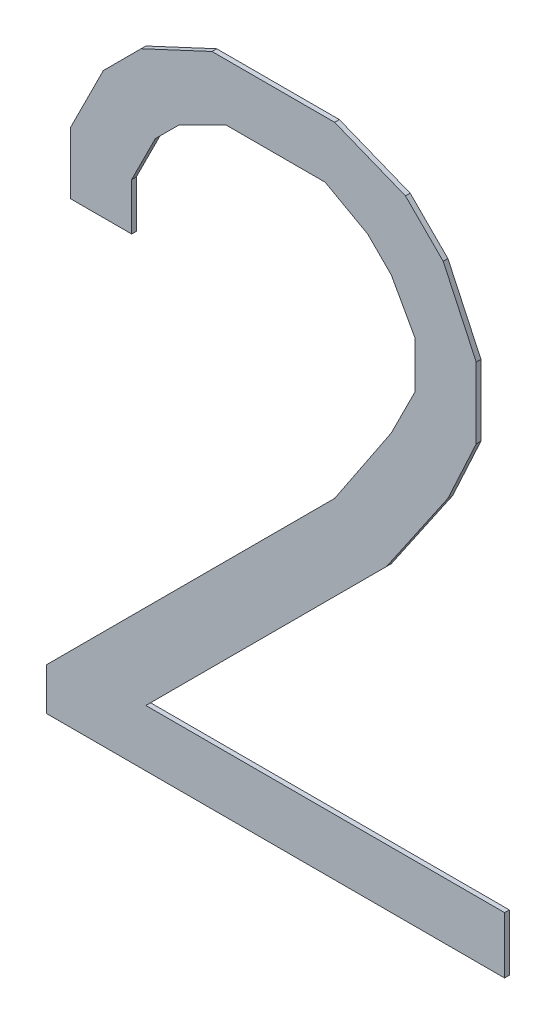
ISO-10303-21;
HEADER;
FILE_DESCRIPTION(('STEP AP214'),'2;1');
FILE_NAME('part.step','',(''),(''),'','','');
FILE_SCHEMA(('AUTOMOTIVE_DESIGN { 1 0 10303 214 1 1 1 1 }'));
ENDSEC;
DATA;
#1=APPLICATION_CONTEXT('core data for automotive mechanical design processes');
#2=APPLICATION_PROTOCOL_DEFINITION('international standard','automotive_design',2000,#1);
#3=PRODUCT_CONTEXT('',#1,'mechanical');
#4=PRODUCT('Part','Part','',(#3));
#5=PRODUCT_RELATED_PRODUCT_CATEGORY('part','',(#4));
#6=PRODUCT_DEFINITION_FORMATION('','',#4);
#7=PRODUCT_DEFINITION_CONTEXT('part definition',#1,'design');
#8=PRODUCT_DEFINITION('design','',#6,#7);
#9=PRODUCT_DEFINITION_SHAPE('','',#8);
#10=(LENGTH_UNIT() NAMED_UNIT(*) SI_UNIT(.MILLI.,.METRE.));
#11=(NAMED_UNIT(*) PLANE_ANGLE_UNIT() SI_UNIT($,.RADIAN.));
#12=(NAMED_UNIT(*) SI_UNIT($,.STERADIAN.) SOLID_ANGLE_UNIT());
#13=UNCERTAINTY_MEASURE_WITH_UNIT(LENGTH_MEASURE(1.E-05),#10,'distance_accuracy_value','');
#14=(GEOMETRIC_REPRESENTATION_CONTEXT(3) GLOBAL_UNCERTAINTY_ASSIGNED_CONTEXT((#13)) GLOBAL_UNIT_ASSIGNED_CONTEXT((#10,
#11,#12)) REPRESENTATION_CONTEXT('',''));
#15=CARTESIAN_POINT('',(0.,0.,0.));
#16=DIRECTION('',(0.,0.,1.));
#17=DIRECTION('',(1.,0.,0.));
#18=AXIS2_PLACEMENT_3D('',#15,#16,#17);
#19=CARTESIAN_POINT('',(-0.4350004,0.27500072,0.01));
#20=DIRECTION('',(0.,0.,-1.));
#21=DIRECTION('',(-1.,0.,0.));
#22=AXIS2_PLACEMENT_3D('',#19,#20,#21);
#23=PLANE('',#22);
#24=DIRECTION('',(0.,1.,0.));
#25=VECTOR('',#24,1.);
#26=CARTESIAN_POINT('',(-0.30500066,0.27500072,0.01));
#27=LINE('',#26,#25);
#28=CARTESIAN_POINT('',(-0.30500066,0.27500072,0.01));
#29=VERTEX_POINT('',#28);
#30=CARTESIAN_POINT('',(-0.30500066,0.37500052,0.01));
#31=VERTEX_POINT('',#30);
#32=EDGE_CURVE('E326',#29,#31,#27,.T.);
#33=ORIENTED_EDGE('',*,*,#32,.T.);
#34=DIRECTION('',(-0.447213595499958,-0.894427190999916,0.));
#35=VECTOR('',#34,1.);
#36=CARTESIAN_POINT('',(-0.30500066,0.37500052,0.01));
#37=LINE('',#36,#35);
#38=CARTESIAN_POINT('',(-0.25500076,0.47500032,0.01));
#39=VERTEX_POINT('',#38);
#40=EDGE_CURVE('E322',#31,#39,#37,.F.);
#41=ORIENTED_EDGE('',*,*,#40,.T.);
#42=DIRECTION('',(-0.707106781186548,-0.707106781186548,0.));
#43=VECTOR('',#42,1.);
#44=CARTESIAN_POINT('',(-0.25500076,0.47500032,0.01));
#45=LINE('',#44,#43);
#46=CARTESIAN_POINT('',(-0.20500086,0.52500022,0.01));
#47=VERTEX_POINT('',#46);
#48=EDGE_CURVE('E318',#39,#47,#45,.F.);
#49=ORIENTED_EDGE('',*,*,#48,.T.);
#50=DIRECTION('',(-0.894427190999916,-0.447213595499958,0.));
#51=VECTOR('',#50,1.);
#52=CARTESIAN_POINT('',(-0.20500086,0.52500022,0.01));
#53=LINE('',#52,#51);
#54=CARTESIAN_POINT('',(-0.10500106,0.57500012,0.01));
#55=VERTEX_POINT('',#54);
#56=EDGE_CURVE('E314',#47,#55,#53,.F.);
#57=ORIENTED_EDGE('',*,*,#56,.T.);
#58=DIRECTION('',(1.,0.,0.));
#59=VECTOR('',#58,1.);
#60=CARTESIAN_POINT('',(-0.10500106,0.57500012,0.01));
#61=LINE('',#60,#59);
#62=CARTESIAN_POINT('',(0.10500106,0.57500012,0.01));
#63=VERTEX_POINT('',#62);
#64=EDGE_CURVE('E310',#55,#63,#61,.T.);
#65=ORIENTED_EDGE('',*,*,#64,.T.);
#66=DIRECTION('',(-0.874157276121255,0.485642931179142,0.));
#67=VECTOR('',#66,1.);
#68=CARTESIAN_POINT('',(0.10500106,0.57500012,0.01));
#69=LINE('',#68,#67);
#70=CARTESIAN_POINT('',(0.195000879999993,0.525000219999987,0.01));
#71=VERTEX_POINT('',#70);
#72=EDGE_CURVE('E306',#63,#71,#69,.F.);
#73=ORIENTED_EDGE('',*,*,#72,.T.);
#74=DIRECTION('',(-0.707106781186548,0.707106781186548,0.));
#75=VECTOR('',#74,1.);
#76=CARTESIAN_POINT('',(0.19500088,0.52500022,0.01));
#77=LINE('',#76,#75);
#78=CARTESIAN_POINT('',(0.24500078,0.47500032,0.01));
#79=VERTEX_POINT('',#78);
#80=EDGE_CURVE('E302',#71,#79,#77,.F.);
#81=ORIENTED_EDGE('',*,*,#80,.T.);
#82=DIRECTION('',(-0.485642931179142,0.874157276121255,0.));
#83=VECTOR('',#82,1.);
#84=CARTESIAN_POINT('',(0.24500078,0.47500032,0.01));
#85=LINE('',#84,#83);
#86=CARTESIAN_POINT('',(0.295000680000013,0.385000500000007,0.01));
#87=VERTEX_POINT('',#86);
#88=EDGE_CURVE('E298',#79,#87,#85,.F.);
#89=ORIENTED_EDGE('',*,*,#88,.T.);
#90=DIRECTION('',(0.,1.,0.));
#91=VECTOR('',#90,1.);
#92=CARTESIAN_POINT('',(0.29500068,0.3850005,0.01));
#93=LINE('',#92,#91);
#94=CARTESIAN_POINT('',(0.29500068,0.2850007,0.01));
#95=VERTEX_POINT('',#94);
#96=EDGE_CURVE('E294',#87,#95,#93,.F.);
#97=ORIENTED_EDGE('',*,*,#96,.T.);
#98=DIRECTION('',(0.447204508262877,0.894431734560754,0.));
#99=VECTOR('',#98,1.);
#100=CARTESIAN_POINT('',(0.29500068,0.2850007,0.01));
#101=LINE('',#100,#99);
#102=CARTESIAN_POINT('',(0.245000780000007,0.184998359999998,0.01));
#103=VERTEX_POINT('',#102);
#104=EDGE_CURVE('E290',#95,#103,#101,.F.);
#105=ORIENTED_EDGE('',*,*,#104,.T.);
#106=DIRECTION('',(0.554700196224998,0.832050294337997,0.));
#107=VECTOR('',#106,1.);
#108=CARTESIAN_POINT('',(0.24500078,0.18499836,0.01));
#109=LINE('',#108,#107);
#110=CARTESIAN_POINT('',(0.125001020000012,0.00499871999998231,0.01));
#111=VERTEX_POINT('',#110);
#112=EDGE_CURVE('E286',#103,#111,#109,.F.);
#113=ORIENTED_EDGE('',*,*,#112,.T.);
#114=DIRECTION('',(0.707108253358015,0.707105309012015,0.));
#115=VECTOR('',#114,1.);
#116=CARTESIAN_POINT('',(0.12500102,0.004998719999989,0.01));
#117=LINE('',#116,#115);
#118=CARTESIAN_POINT('',(-0.485000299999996,-0.605000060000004,0.01));
#119=VERTEX_POINT('',#118);
#120=EDGE_CURVE('E282',#111,#119,#117,.F.);
#121=ORIENTED_EDGE('',*,*,#120,.T.);
#122=DIRECTION('',(0.,1.,0.));
#123=VECTOR('',#122,1.);
#124=CARTESIAN_POINT('',(-0.4850003,-0.60500006,0.01));
#125=LINE('',#124,#123);
#126=CARTESIAN_POINT('',(-0.4850003,-0.69499988,0.01));
#127=VERTEX_POINT('',#126);
#128=EDGE_CURVE('E278',#119,#127,#125,.F.);
#129=ORIENTED_EDGE('',*,*,#128,.T.);
#130=DIRECTION('',(1.,0.,0.));
#131=VECTOR('',#130,1.);
#132=CARTESIAN_POINT('',(-0.4850003,-0.69499988,0.01));
#133=LINE('',#132,#131);
#134=CARTESIAN_POINT('',(0.4850003,-0.69499988,0.01));
#135=VERTEX_POINT('',#134);
#136=EDGE_CURVE('E274',#127,#135,#133,.T.);
#137=ORIENTED_EDGE('',*,*,#136,.T.);
#138=DIRECTION('',(0.,1.,0.));
#139=VECTOR('',#138,1.);
#140=CARTESIAN_POINT('',(0.4850003,-0.69499988,0.01));
#141=LINE('',#140,#139);
#142=CARTESIAN_POINT('',(0.4850003,-0.57500012,0.01));
#143=VERTEX_POINT('',#142);
#144=EDGE_CURVE('E270',#135,#143,#141,.T.);
#145=ORIENTED_EDGE('',*,*,#144,.T.);
#146=DIRECTION('',(1.,0.,0.));
#147=VECTOR('',#146,1.);
#148=CARTESIAN_POINT('',(0.4850003,-0.57500012,0.01));
#149=LINE('',#148,#147);
#150=CARTESIAN_POINT('',(-0.27500072,-0.57500012,0.01));
#151=VERTEX_POINT('',#150);
#152=EDGE_CURVE('E266',#143,#151,#149,.F.);
#153=ORIENTED_EDGE('',*,*,#152,.T.);
#154=DIRECTION('',(-0.707108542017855,-0.707105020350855,0.));
#155=VECTOR('',#154,1.);
#156=CARTESIAN_POINT('',(-0.27500072,-0.57500012,0.01));
#157=LINE('',#156,#155);
#158=CARTESIAN_POINT('',(0.235000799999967,-0.0650011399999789,0.01));
#159=VERTEX_POINT('',#158);
#160=EDGE_CURVE('E262',#151,#159,#157,.F.);
#161=ORIENTED_EDGE('',*,*,#160,.T.);
#162=DIRECTION('',(-0.564683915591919,-0.825307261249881,0.));
#163=VECTOR('',#162,1.);
#164=CARTESIAN_POINT('',(0.2350008,-0.06500114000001,0.01));
#165=LINE('',#164,#163);
#166=CARTESIAN_POINT('',(0.365000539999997,0.124998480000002,0.01));
#167=VERTEX_POINT('',#166);
#168=EDGE_CURVE('E258',#159,#167,#165,.F.);
#169=ORIENTED_EDGE('',*,*,#168,.T.);
#170=DIRECTION('',(-0.419051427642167,-0.907962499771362,0.));
#171=VECTOR('',#170,1.);
#172=CARTESIAN_POINT('',(0.36500054,0.12499848,0.01));
#173=LINE('',#172,#171);
#174=CARTESIAN_POINT('',(0.42500041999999,0.255000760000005,0.01));
#175=VERTEX_POINT('',#174);
#176=EDGE_CURVE('E254',#167,#175,#173,.F.);
#177=ORIENTED_EDGE('',*,*,#176,.T.);
#178=DIRECTION('',(0.,1.,0.));
#179=VECTOR('',#178,1.);
#180=CARTESIAN_POINT('',(0.42500042,0.25500076,0.01));
#181=LINE('',#180,#179);
#182=CARTESIAN_POINT('',(0.42500042,0.40500046,0.01));
#183=VERTEX_POINT('',#182);
#184=EDGE_CURVE('E250',#175,#183,#181,.T.);
#185=ORIENTED_EDGE('',*,*,#184,.T.);
#186=DIRECTION('',(0.422885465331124,-0.906183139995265,0.));
#187=VECTOR('',#186,1.);
#188=CARTESIAN_POINT('',(0.42500042,0.40500046,0.01));
#189=LINE('',#188,#187);
#190=CARTESIAN_POINT('',(0.35500056,0.55500016,0.01));
#191=VERTEX_POINT('',#190);
#192=EDGE_CURVE('E246',#183,#191,#189,.F.);
#193=ORIENTED_EDGE('',*,*,#192,.T.);
#194=DIRECTION('',(0.707106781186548,-0.707106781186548,0.));
#195=VECTOR('',#194,1.);
#196=CARTESIAN_POINT('',(0.35500056,0.55500016,0.01));
#197=LINE('',#196,#195);
#198=CARTESIAN_POINT('',(0.27500072,0.635,0.01));
#199=VERTEX_POINT('',#198);
#200=EDGE_CURVE('E242',#191,#199,#197,.F.);
#201=ORIENTED_EDGE('',*,*,#200,.T.);
#202=DIRECTION('',(0.928476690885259,-0.371390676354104,0.));
#203=VECTOR('',#202,1.);
#204=CARTESIAN_POINT('',(0.27500072,0.635,0.01));
#205=LINE('',#204,#203);
#206=CARTESIAN_POINT('',(0.12500102,0.69499988,0.01));
#207=VERTEX_POINT('',#206);
#208=EDGE_CURVE('E238',#199,#207,#205,.F.);
#209=ORIENTED_EDGE('',*,*,#208,.T.);
#210=DIRECTION('',(1.,0.,0.));
#211=VECTOR('',#210,1.);
#212=CARTESIAN_POINT('',(0.12500102,0.69499988,0.01));
#213=LINE('',#212,#211);
#214=CARTESIAN_POINT('',(-0.135001,0.69499988,0.01));
#215=VERTEX_POINT('',#214);
#216=EDGE_CURVE('E234',#207,#215,#213,.F.);
#217=ORIENTED_EDGE('',*,*,#216,.T.);
#218=DIRECTION('',(0.906183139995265,0.422885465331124,0.));
#219=VECTOR('',#218,1.);
#220=CARTESIAN_POINT('',(-0.135001,0.69499988,0.01));
#221=LINE('',#220,#219);
#222=CARTESIAN_POINT('',(-0.2850007,0.62500002,0.01));
#223=VERTEX_POINT('',#222);
#224=EDGE_CURVE('E230',#215,#223,#221,.F.);
#225=ORIENTED_EDGE('',*,*,#224,.T.);
#226=DIRECTION('',(0.707106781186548,0.707106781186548,0.));
#227=VECTOR('',#226,1.);
#228=CARTESIAN_POINT('',(-0.2850007,0.62500002,0.01));
#229=LINE('',#228,#227);
#230=CARTESIAN_POINT('',(-0.36500054,0.54500018,0.01));
#231=VERTEX_POINT('',#230);
#232=EDGE_CURVE('E206',#223,#231,#229,.F.);
#233=ORIENTED_EDGE('',*,*,#232,.T.);
#234=DIRECTION('',(0.447213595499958,0.894427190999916,0.));
#235=VECTOR('',#234,1.);
#236=CARTESIAN_POINT('',(-0.36500054,0.54500018,0.01));
#237=LINE('',#236,#235);
#238=CARTESIAN_POINT('',(-0.4350004,0.40500046,0.01));
#239=VERTEX_POINT('',#238);
#240=EDGE_CURVE('E208',#231,#239,#237,.F.);
#241=ORIENTED_EDGE('',*,*,#240,.T.);
#242=DIRECTION('',(0.,1.,0.));
#243=VECTOR('',#242,1.);
#244=CARTESIAN_POINT('',(-0.4350004,0.40500046,0.01));
#245=LINE('',#244,#243);
#246=CARTESIAN_POINT('',(-0.4350004,0.27500072,0.01));
#247=VERTEX_POINT('',#246);
#248=EDGE_CURVE('E20',#239,#247,#245,.F.);
#249=ORIENTED_EDGE('',*,*,#248,.T.);
#250=DIRECTION('',(1.,0.,0.));
#251=VECTOR('',#250,1.);
#252=CARTESIAN_POINT('',(-0.4350004,0.27500072,0.01));
#253=LINE('',#252,#251);
#254=EDGE_CURVE('E331',#247,#29,#253,.T.);
#255=ORIENTED_EDGE('',*,*,#254,.T.);
#256=EDGE_LOOP('',(#33,#41,#49,#57,#65,#73,#81,#89,#97,#105,#113,#121,#129,#137,#145,#153,#161,
#169,#177,#185,#193,#201,#209,#217,#225,#233,#241,#249,#255));
#257=FACE_BOUND('',#256,.T.);
#258=ADVANCED_FACE('F17',(#257),#23,.F.);
#259=CARTESIAN_POINT('',(-0.4350004,0.40500046,0.));
#260=DIRECTION('',(1.,0.,0.));
#261=DIRECTION('',(0.,0.,-1.));
#262=AXIS2_PLACEMENT_3D('',#259,#260,#261);
#263=PLANE('',#262);
#264=DIRECTION('',(0.,0.,1.));
#265=VECTOR('',#264,1.);
#266=CARTESIAN_POINT('',(-0.4350004,0.27500072,0.));
#267=LINE('',#266,#265);
#268=CARTESIAN_POINT('',(-0.4350004,0.27500072,0.));
#269=VERTEX_POINT('',#268);
#270=EDGE_CURVE('E219',#269,#247,#267,.T.);
#271=ORIENTED_EDGE('',*,*,#270,.T.);
#272=ORIENTED_EDGE('',*,*,#248,.F.);
#273=DIRECTION('',(0.,0.,1.));
#274=VECTOR('',#273,1.);
#275=CARTESIAN_POINT('',(-0.4350004,0.40500046,0.));
#276=LINE('',#275,#274);
#277=CARTESIAN_POINT('',(-0.4350004,0.40500046,0.));
#278=VERTEX_POINT('',#277);
#279=EDGE_CURVE('E214',#239,#278,#276,.F.);
#280=ORIENTED_EDGE('',*,*,#279,.T.);
#281=DIRECTION('',(0.,1.,0.));
#282=VECTOR('',#281,1.);
#283=CARTESIAN_POINT('',(-0.4350004,0.27500072,0.));
#284=LINE('',#283,#282);
#285=EDGE_CURVE('E334',#269,#278,#284,.T.);
#286=ORIENTED_EDGE('',*,*,#285,.F.);
#287=EDGE_LOOP('',(#271,#272,#280,#286));
#288=FACE_BOUND('',#287,.T.);
#289=ADVANCED_FACE('F216',(#288),#263,.F.);
#290=CARTESIAN_POINT('',(-0.36500054,0.54500018,0.));
#291=DIRECTION('',(0.894427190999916,-0.447213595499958,0.));
#292=DIRECTION('',(0.447213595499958,0.894427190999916,0.));
#293=AXIS2_PLACEMENT_3D('',#290,#291,#292);
#294=PLANE('',#293);
#295=ORIENTED_EDGE('',*,*,#279,.F.);
#296=ORIENTED_EDGE('',*,*,#240,.F.);
#297=DIRECTION('',(0.,0.,1.));
#298=VECTOR('',#297,1.);
#299=CARTESIAN_POINT('',(-0.36500054,0.54500018,0.));
#300=LINE('',#299,#298);
#301=CARTESIAN_POINT('',(-0.36500054,0.54500018,0.));
#302=VERTEX_POINT('',#301);
#303=EDGE_CURVE('E226',#231,#302,#300,.F.);
#304=ORIENTED_EDGE('',*,*,#303,.T.);
#305=DIRECTION('',(0.447213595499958,0.894427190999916,0.));
#306=VECTOR('',#305,1.);
#307=CARTESIAN_POINT('',(-0.4350004,0.40500046,0.));
#308=LINE('',#307,#306);
#309=EDGE_CURVE('E223',#278,#302,#308,.T.);
#310=ORIENTED_EDGE('',*,*,#309,.F.);
#311=EDGE_LOOP('',(#295,#296,#304,#310));
#312=FACE_BOUND('',#311,.T.);
#313=ADVANCED_FACE('F221',(#312),#294,.F.);
#314=CARTESIAN_POINT('',(-0.2850007,0.62500002,0.));
#315=DIRECTION('',(0.707106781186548,-0.707106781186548,0.));
#316=DIRECTION('',(0.707106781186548,0.707106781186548,0.));
#317=AXIS2_PLACEMENT_3D('',#314,#315,#316);
#318=PLANE('',#317);
#319=ORIENTED_EDGE('',*,*,#303,.F.);
#320=ORIENTED_EDGE('',*,*,#232,.F.);
#321=DIRECTION('',(0.,0.,1.));
#322=VECTOR('',#321,1.);
#323=CARTESIAN_POINT('',(-0.2850007,0.62500002,0.));
#324=LINE('',#323,#322);
#325=CARTESIAN_POINT('',(-0.2850007,0.62500002,0.));
#326=VERTEX_POINT('',#325);
#327=EDGE_CURVE('E232',#223,#326,#324,.F.);
#328=ORIENTED_EDGE('',*,*,#327,.T.);
#329=DIRECTION('',(0.707106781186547,0.707106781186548,0.));
#330=VECTOR('',#329,1.);
#331=CARTESIAN_POINT('',(-0.36500054,0.54500018,0.));
#332=LINE('',#331,#330);
#333=EDGE_CURVE('E337',#302,#326,#332,.T.);
#334=ORIENTED_EDGE('',*,*,#333,.F.);
#335=EDGE_LOOP('',(#319,#320,#328,#334));
#336=FACE_BOUND('',#335,.T.);
#337=ADVANCED_FACE('F539',(#336),#318,.F.);
#338=CARTESIAN_POINT('',(-0.135001,0.69499988,0.));
#339=DIRECTION('',(0.422885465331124,-0.906183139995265,0.));
#340=DIRECTION('',(0.906183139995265,0.422885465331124,0.));
#341=AXIS2_PLACEMENT_3D('',#338,#339,#340);
#342=PLANE('',#341);
#343=ORIENTED_EDGE('',*,*,#327,.F.);
#344=ORIENTED_EDGE('',*,*,#224,.F.);
#345=DIRECTION('',(0.,0.,-1.));
#346=VECTOR('',#345,1.);
#347=CARTESIAN_POINT('',(-0.135001,0.69499988,0.));
#348=LINE('',#347,#346);
#349=CARTESIAN_POINT('',(-0.135001,0.69499988,0.));
#350=VERTEX_POINT('',#349);
#351=EDGE_CURVE('E236',#215,#350,#348,.T.);
#352=ORIENTED_EDGE('',*,*,#351,.T.);
#353=DIRECTION('',(0.906183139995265,0.422885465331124,0.));
#354=VECTOR('',#353,1.);
#355=CARTESIAN_POINT('',(-0.2850007,0.62500002,0.));
#356=LINE('',#355,#354);
#357=EDGE_CURVE('E340',#326,#350,#356,.T.);
#358=ORIENTED_EDGE('',*,*,#357,.F.);
#359=EDGE_LOOP('',(#343,#344,#352,#358));
#360=FACE_BOUND('',#359,.T.);
#361=ADVANCED_FACE('F535',(#360),#342,.F.);
#362=CARTESIAN_POINT('',(0.12500102,0.69499988,0.));
#363=DIRECTION('',(0.,-1.,0.));
#364=DIRECTION('',(0.,0.,-1.));
#365=AXIS2_PLACEMENT_3D('',#362,#363,#364);
#366=PLANE('',#365);
#367=ORIENTED_EDGE('',*,*,#351,.F.);
#368=ORIENTED_EDGE('',*,*,#216,.F.);
#369=DIRECTION('',(0.,0.,1.));
#370=VECTOR('',#369,1.);
#371=CARTESIAN_POINT('',(0.12500102,0.69499988,0.));
#372=LINE('',#371,#370);
#373=CARTESIAN_POINT('',(0.12500102,0.69499988,0.));
#374=VERTEX_POINT('',#373);
#375=EDGE_CURVE('E240',#207,#374,#372,.F.);
#376=ORIENTED_EDGE('',*,*,#375,.T.);
#377=DIRECTION('',(-1.,0.,0.));
#378=VECTOR('',#377,1.);
#379=CARTESIAN_POINT('',(-0.4350004,0.69499988,0.));
#380=LINE('',#379,#378);
#381=EDGE_CURVE('E343',#350,#374,#380,.F.);
#382=ORIENTED_EDGE('',*,*,#381,.F.);
#383=EDGE_LOOP('',(#367,#368,#376,#382));
#384=FACE_BOUND('',#383,.T.);
#385=ADVANCED_FACE('F531',(#384),#366,.F.);
#386=CARTESIAN_POINT('',(0.27500072,0.635,0.));
#387=DIRECTION('',(-0.371390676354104,-0.928476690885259,0.));
#388=DIRECTION('',(0.928476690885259,-0.371390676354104,0.));
#389=AXIS2_PLACEMENT_3D('',#386,#387,#388);
#390=PLANE('',#389);
#391=ORIENTED_EDGE('',*,*,#375,.F.);
#392=ORIENTED_EDGE('',*,*,#208,.F.);
#393=DIRECTION('',(0.,0.,1.));
#394=VECTOR('',#393,1.);
#395=CARTESIAN_POINT('',(0.27500072,0.635,0.));
#396=LINE('',#395,#394);
#397=CARTESIAN_POINT('',(0.27500072,0.635,0.));
#398=VERTEX_POINT('',#397);
#399=EDGE_CURVE('E244',#199,#398,#396,.F.);
#400=ORIENTED_EDGE('',*,*,#399,.T.);
#401=DIRECTION('',(0.928476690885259,-0.371390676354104,0.));
#402=VECTOR('',#401,1.);
#403=CARTESIAN_POINT('',(0.12500102,0.69499988,0.));
#404=LINE('',#403,#402);
#405=EDGE_CURVE('E346',#374,#398,#404,.T.);
#406=ORIENTED_EDGE('',*,*,#405,.F.);
#407=EDGE_LOOP('',(#391,#392,#400,#406));
#408=FACE_BOUND('',#407,.T.);
#409=ADVANCED_FACE('F526',(#408),#390,.F.);
#410=CARTESIAN_POINT('',(0.35500056,0.55500016,0.));
#411=DIRECTION('',(-0.707106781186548,-0.707106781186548,0.));
#412=DIRECTION('',(0.707106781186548,-0.707106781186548,0.));
#413=AXIS2_PLACEMENT_3D('',#410,#411,#412);
#414=PLANE('',#413);
#415=ORIENTED_EDGE('',*,*,#399,.F.);
#416=ORIENTED_EDGE('',*,*,#200,.F.);
#417=DIRECTION('',(0.,0.,1.));
#418=VECTOR('',#417,1.);
#419=CARTESIAN_POINT('',(0.35500056,0.55500016,0.));
#420=LINE('',#419,#418);
#421=CARTESIAN_POINT('',(0.35500056,0.55500016,0.));
#422=VERTEX_POINT('',#421);
#423=EDGE_CURVE('E248',#191,#422,#420,.F.);
#424=ORIENTED_EDGE('',*,*,#423,.T.);
#425=DIRECTION('',(0.707106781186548,-0.707106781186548,0.));
#426=VECTOR('',#425,1.);
#427=CARTESIAN_POINT('',(0.27500072,0.635,0.));
#428=LINE('',#427,#426);
#429=EDGE_CURVE('E349',#398,#422,#428,.T.);
#430=ORIENTED_EDGE('',*,*,#429,.F.);
#431=EDGE_LOOP('',(#415,#416,#424,#430));
#432=FACE_BOUND('',#431,.T.);
#433=ADVANCED_FACE('F521',(#432),#414,.F.);
#434=CARTESIAN_POINT('',(0.42500042,0.40500046,0.));
#435=DIRECTION('',(-0.906183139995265,-0.422885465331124,0.));
#436=DIRECTION('',(0.422885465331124,-0.906183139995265,0.));
#437=AXIS2_PLACEMENT_3D('',#434,#435,#436);
#438=PLANE('',#437);
#439=ORIENTED_EDGE('',*,*,#423,.F.);
#440=ORIENTED_EDGE('',*,*,#192,.F.);
#441=DIRECTION('',(0.,0.,1.));
#442=VECTOR('',#441,1.);
#443=CARTESIAN_POINT('',(0.42500042,0.40500046,0.));
#444=LINE('',#443,#442);
#445=CARTESIAN_POINT('',(0.42500042,0.40500046,0.));
#446=VERTEX_POINT('',#445);
#447=EDGE_CURVE('E252',#183,#446,#444,.F.);
#448=ORIENTED_EDGE('',*,*,#447,.T.);
#449=DIRECTION('',(0.422885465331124,-0.906183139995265,0.));
#450=VECTOR('',#449,1.);
#451=CARTESIAN_POINT('',(0.35500056,0.55500016,0.));
#452=LINE('',#451,#450);
#453=EDGE_CURVE('E352',#422,#446,#452,.T.);
#454=ORIENTED_EDGE('',*,*,#453,.F.);
#455=EDGE_LOOP('',(#439,#440,#448,#454));
#456=FACE_BOUND('',#455,.T.);
#457=ADVANCED_FACE('F516',(#456),#438,.F.);
#458=CARTESIAN_POINT('',(0.42500042,0.25500076,0.));
#459=DIRECTION('',(-1.,0.,0.));
#460=DIRECTION('',(0.,0.,1.));
#461=AXIS2_PLACEMENT_3D('',#458,#459,#460);
#462=PLANE('',#461);
#463=ORIENTED_EDGE('',*,*,#447,.F.);
#464=ORIENTED_EDGE('',*,*,#184,.F.);
#465=DIRECTION('',(0.,0.,1.));
#466=VECTOR('',#465,1.);
#467=CARTESIAN_POINT('',(0.425000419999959,0.255000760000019,0.));
#468=LINE('',#467,#466);
#469=CARTESIAN_POINT('',(0.42500041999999,0.255000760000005,0.));
#470=VERTEX_POINT('',#469);
#471=EDGE_CURVE('E256',#175,#470,#468,.F.);
#472=ORIENTED_EDGE('',*,*,#471,.T.);
#473=DIRECTION('',(0.,1.,0.));
#474=VECTOR('',#473,1.);
#475=CARTESIAN_POINT('',(0.42500042,0.27500072,0.));
#476=LINE('',#475,#474);
#477=EDGE_CURVE('E355',#446,#470,#476,.F.);
#478=ORIENTED_EDGE('',*,*,#477,.F.);
#479=EDGE_LOOP('',(#463,#464,#472,#478));
#480=FACE_BOUND('',#479,.T.);
#481=ADVANCED_FACE('F511',(#480),#462,.F.);
#482=CARTESIAN_POINT('',(0.36500054,0.12499848,0.));
#483=DIRECTION('',(-0.907962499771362,0.419051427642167,0.));
#484=DIRECTION('',(-0.419051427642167,-0.907962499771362,0.));
#485=AXIS2_PLACEMENT_3D('',#482,#483,#484);
#486=PLANE('',#485);
#487=ORIENTED_EDGE('',*,*,#471,.F.);
#488=ORIENTED_EDGE('',*,*,#176,.F.);
#489=DIRECTION('',(0.,0.,1.));
#490=VECTOR('',#489,1.);
#491=CARTESIAN_POINT('',(0.365000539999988,0.124998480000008,0.));
#492=LINE('',#491,#490);
#493=CARTESIAN_POINT('',(0.365000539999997,0.124998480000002,0.));
#494=VERTEX_POINT('',#493);
#495=EDGE_CURVE('E260',#167,#494,#492,.F.);
#496=ORIENTED_EDGE('',*,*,#495,.T.);
#497=DIRECTION('',(-0.419051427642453,-0.907962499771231,0.));
#498=VECTOR('',#497,1.);
#499=CARTESIAN_POINT('',(0.42500042,0.25500076,0.));
#500=LINE('',#499,#498);
#501=EDGE_CURVE('E358',#470,#494,#500,.T.);
#502=ORIENTED_EDGE('',*,*,#501,.F.);
#503=EDGE_LOOP('',(#487,#488,#496,#502));
#504=FACE_BOUND('',#503,.T.);
#505=ADVANCED_FACE('F506',(#504),#486,.F.);
#506=CARTESIAN_POINT('',(0.2350008,-0.06500114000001,0.));
#507=DIRECTION('',(-0.825307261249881,0.564683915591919,0.));
#508=DIRECTION('',(-0.564683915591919,-0.825307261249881,0.));
#509=AXIS2_PLACEMENT_3D('',#506,#507,#508);
#510=PLANE('',#509);
#511=ORIENTED_EDGE('',*,*,#495,.F.);
#512=ORIENTED_EDGE('',*,*,#168,.F.);
#513=DIRECTION('',(0.,0.,1.));
#514=VECTOR('',#513,1.);
#515=CARTESIAN_POINT('',(0.235000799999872,-0.0650011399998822,0.));
#516=LINE('',#515,#514);
#517=CARTESIAN_POINT('',(0.235000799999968,-0.0650011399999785,0.));
#518=VERTEX_POINT('',#517);
#519=EDGE_CURVE('E264',#159,#518,#516,.F.);
#520=ORIENTED_EDGE('',*,*,#519,.T.);
#521=DIRECTION('',(-0.56468391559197,-0.825307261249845,0.));
#522=VECTOR('',#521,1.);
#523=CARTESIAN_POINT('',(0.36500054,0.12499848,0.));
#524=LINE('',#523,#522);
#525=EDGE_CURVE('E361',#494,#518,#524,.T.);
#526=ORIENTED_EDGE('',*,*,#525,.F.);
#527=EDGE_LOOP('',(#511,#512,#520,#526));
#528=FACE_BOUND('',#527,.T.);
#529=ADVANCED_FACE('F501',(#528),#510,.F.);
#530=CARTESIAN_POINT('',(-0.27500072,-0.57500012,0.));
#531=DIRECTION('',(-0.707105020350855,0.707108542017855,0.));
#532=DIRECTION('',(-0.707108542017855,-0.707105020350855,0.));
#533=AXIS2_PLACEMENT_3D('',#530,#531,#532);
#534=PLANE('',#533);
#535=ORIENTED_EDGE('',*,*,#519,.F.);
#536=ORIENTED_EDGE('',*,*,#160,.F.);
#537=DIRECTION('',(0.,0.,-1.));
#538=VECTOR('',#537,1.);
#539=CARTESIAN_POINT('',(-0.27500072,-0.57500012,0.));
#540=LINE('',#539,#538);
#541=CARTESIAN_POINT('',(-0.27500072,-0.57500012,0.));
#542=VERTEX_POINT('',#541);
#543=EDGE_CURVE('E268',#151,#542,#540,.T.);
#544=ORIENTED_EDGE('',*,*,#543,.T.);
#545=DIRECTION('',(-0.707108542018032,-0.707105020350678,0.));
#546=VECTOR('',#545,1.);
#547=CARTESIAN_POINT('',(0.2350008,-0.06500114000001,0.));
#548=LINE('',#547,#546);
#549=EDGE_CURVE('E364',#518,#542,#548,.T.);
#550=ORIENTED_EDGE('',*,*,#549,.F.);
#551=EDGE_LOOP('',(#535,#536,#544,#550));
#552=FACE_BOUND('',#551,.T.);
#553=ADVANCED_FACE('F496',(#552),#534,.F.);
#554=CARTESIAN_POINT('',(0.4850003,-0.57500012,0.));
#555=DIRECTION('',(0.,-1.,0.));
#556=DIRECTION('',(0.,0.,-1.));
#557=AXIS2_PLACEMENT_3D('',#554,#555,#556);
#558=PLANE('',#557);
#559=ORIENTED_EDGE('',*,*,#543,.F.);
#560=ORIENTED_EDGE('',*,*,#152,.F.);
#561=DIRECTION('',(0.,0.,1.));
#562=VECTOR('',#561,1.);
#563=CARTESIAN_POINT('',(0.4850003,-0.57500012,0.));
#564=LINE('',#563,#562);
#565=CARTESIAN_POINT('',(0.4850003,-0.57500012,0.));
#566=VERTEX_POINT('',#565);
#567=EDGE_CURVE('E272',#143,#566,#564,.F.);
#568=ORIENTED_EDGE('',*,*,#567,.T.);
#569=DIRECTION('',(-1.,0.,0.));
#570=VECTOR('',#569,1.);
#571=CARTESIAN_POINT('',(-0.4350004,-0.57500012,0.));
#572=LINE('',#571,#570);
#573=EDGE_CURVE('E367',#542,#566,#572,.F.);
#574=ORIENTED_EDGE('',*,*,#573,.F.);
#575=EDGE_LOOP('',(#559,#560,#568,#574));
#576=FACE_BOUND('',#575,.T.);
#577=ADVANCED_FACE('F491',(#576),#558,.F.);
#578=CARTESIAN_POINT('',(0.4850003,-0.69499988,0.));
#579=DIRECTION('',(-1.,0.,0.));
#580=DIRECTION('',(0.,0.,1.));
#581=AXIS2_PLACEMENT_3D('',#578,#579,#580);
#582=PLANE('',#581);
#583=ORIENTED_EDGE('',*,*,#567,.F.);
#584=ORIENTED_EDGE('',*,*,#144,.F.);
#585=DIRECTION('',(0.,0.,1.));
#586=VECTOR('',#585,1.);
#587=CARTESIAN_POINT('',(0.4850003,-0.69499988,0.));
#588=LINE('',#587,#586);
#589=CARTESIAN_POINT('',(0.4850003,-0.69499988,0.));
#590=VERTEX_POINT('',#589);
#591=EDGE_CURVE('E276',#135,#590,#588,.F.);
#592=ORIENTED_EDGE('',*,*,#591,.T.);
#593=DIRECTION('',(0.,1.,0.));
#594=VECTOR('',#593,1.);
#595=CARTESIAN_POINT('',(0.4850003,0.27500072,0.));
#596=LINE('',#595,#594);
#597=EDGE_CURVE('E370',#566,#590,#596,.F.);
#598=ORIENTED_EDGE('',*,*,#597,.F.);
#599=EDGE_LOOP('',(#583,#584,#592,#598));
#600=FACE_BOUND('',#599,.T.);
#601=ADVANCED_FACE('F486',(#600),#582,.F.);
#602=CARTESIAN_POINT('',(-0.4850003,-0.69499988,0.));
#603=DIRECTION('',(0.,1.,0.));
#604=DIRECTION('',(0.,0.,1.));
#605=AXIS2_PLACEMENT_3D('',#602,#603,#604);
#606=PLANE('',#605);
#607=ORIENTED_EDGE('',*,*,#591,.F.);
#608=ORIENTED_EDGE('',*,*,#136,.F.);
#609=DIRECTION('',(0.,0.,-1.));
#610=VECTOR('',#609,1.);
#611=CARTESIAN_POINT('',(-0.4850003,-0.69499988,0.));
#612=LINE('',#611,#610);
#613=CARTESIAN_POINT('',(-0.4850003,-0.69499988,0.));
#614=VERTEX_POINT('',#613);
#615=EDGE_CURVE('E280',#127,#614,#612,.T.);
#616=ORIENTED_EDGE('',*,*,#615,.T.);
#617=DIRECTION('',(-1.,0.,0.));
#618=VECTOR('',#617,1.);
#619=CARTESIAN_POINT('',(-0.4350004,-0.69499988,0.));
#620=LINE('',#619,#618);
#621=EDGE_CURVE('E373',#590,#614,#620,.T.);
#622=ORIENTED_EDGE('',*,*,#621,.F.);
#623=EDGE_LOOP('',(#607,#608,#616,#622));
#624=FACE_BOUND('',#623,.T.);
#625=ADVANCED_FACE('F481',(#624),#606,.F.);
#626=CARTESIAN_POINT('',(-0.4850003,-0.60500006,0.));
#627=DIRECTION('',(1.,0.,0.));
#628=DIRECTION('',(0.,0.,-1.));
#629=AXIS2_PLACEMENT_3D('',#626,#627,#628);
#630=PLANE('',#629);
#631=ORIENTED_EDGE('',*,*,#615,.F.);
#632=ORIENTED_EDGE('',*,*,#128,.F.);
#633=DIRECTION('',(0.,0.,1.));
#634=VECTOR('',#633,1.);
#635=CARTESIAN_POINT('',(-0.485000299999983,-0.605000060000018,0.));
#636=LINE('',#635,#634);
#637=CARTESIAN_POINT('',(-0.485000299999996,-0.605000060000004,0.));
#638=VERTEX_POINT('',#637);
#639=EDGE_CURVE('E284',#119,#638,#636,.F.);
#640=ORIENTED_EDGE('',*,*,#639,.T.);
#641=DIRECTION('',(0.,1.,0.));
#642=VECTOR('',#641,1.);
#643=CARTESIAN_POINT('',(-0.4850003,0.27500072,0.));
#644=LINE('',#643,#642);
#645=EDGE_CURVE('E376',#614,#638,#644,.T.);
#646=ORIENTED_EDGE('',*,*,#645,.F.);
#647=EDGE_LOOP('',(#631,#632,#640,#646));
#648=FACE_BOUND('',#647,.T.);
#649=ADVANCED_FACE('F476',(#648),#630,.F.);
#650=CARTESIAN_POINT('',(0.12500102,0.004998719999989,0.));
#651=DIRECTION('',(0.707105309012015,-0.707108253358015,0.));
#652=DIRECTION('',(0.707108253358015,0.707105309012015,0.));
#653=AXIS2_PLACEMENT_3D('',#650,#651,#652);
#654=PLANE('',#653);
#655=ORIENTED_EDGE('',*,*,#639,.F.);
#656=ORIENTED_EDGE('',*,*,#120,.F.);
#657=DIRECTION('',(0.,0.,1.));
#658=VECTOR('',#657,1.);
#659=CARTESIAN_POINT('',(0.125001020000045,0.00499871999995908,0.));
#660=LINE('',#659,#658);
#661=CARTESIAN_POINT('',(0.125001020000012,0.00499871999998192,0.));
#662=VERTEX_POINT('',#661);
#663=EDGE_CURVE('E288',#111,#662,#660,.F.);
#664=ORIENTED_EDGE('',*,*,#663,.T.);
#665=DIRECTION('',(0.707108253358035,0.707105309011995,0.));
#666=VECTOR('',#665,1.);
#667=CARTESIAN_POINT('',(-0.4850003,-0.60500006,0.));
#668=LINE('',#667,#666);
#669=EDGE_CURVE('E379',#638,#662,#668,.T.);
#670=ORIENTED_EDGE('',*,*,#669,.F.);
#671=EDGE_LOOP('',(#655,#656,#664,#670));
#672=FACE_BOUND('',#671,.T.);
#673=ADVANCED_FACE('F471',(#672),#654,.F.);
#674=CARTESIAN_POINT('',(0.24500078,0.18499836,0.));
#675=DIRECTION('',(0.832050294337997,-0.554700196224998,0.));
#676=DIRECTION('',(0.554700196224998,0.832050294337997,0.));
#677=AXIS2_PLACEMENT_3D('',#674,#675,#676);
#678=PLANE('',#677);
#679=ORIENTED_EDGE('',*,*,#663,.F.);
#680=ORIENTED_EDGE('',*,*,#112,.F.);
#681=DIRECTION('',(0.,0.,1.));
#682=VECTOR('',#681,1.);
#683=CARTESIAN_POINT('',(0.245000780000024,0.184998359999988,0.));
#684=LINE('',#683,#682);
#685=CARTESIAN_POINT('',(0.245000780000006,0.184998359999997,0.));
#686=VERTEX_POINT('',#685);
#687=EDGE_CURVE('E292',#103,#686,#684,.F.);
#688=ORIENTED_EDGE('',*,*,#687,.T.);
#689=DIRECTION('',(0.554700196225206,0.832050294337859,0.));
#690=VECTOR('',#689,1.);
#691=CARTESIAN_POINT('',(0.12500102,0.00499871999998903,0.));
#692=LINE('',#691,#690);
#693=EDGE_CURVE('E382',#662,#686,#692,.T.);
#694=ORIENTED_EDGE('',*,*,#693,.F.);
#695=EDGE_LOOP('',(#679,#680,#688,#694));
#696=FACE_BOUND('',#695,.T.);
#697=ADVANCED_FACE('F466',(#696),#678,.F.);
#698=CARTESIAN_POINT('',(0.29500068,0.2850007,0.));
#699=DIRECTION('',(0.894431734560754,-0.447204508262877,0.));
#700=DIRECTION('',(0.447204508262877,0.894431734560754,0.));
#701=AXIS2_PLACEMENT_3D('',#698,#699,#700);
#702=PLANE('',#701);
#703=ORIENTED_EDGE('',*,*,#687,.F.);
#704=ORIENTED_EDGE('',*,*,#104,.F.);
#705=DIRECTION('',(0.,0.,-1.));
#706=VECTOR('',#705,1.);
#707=CARTESIAN_POINT('',(0.29500068,0.2850007,0.));
#708=LINE('',#707,#706);
#709=CARTESIAN_POINT('',(0.29500068,0.2850007,0.));
#710=VERTEX_POINT('',#709);
#711=EDGE_CURVE('E296',#95,#710,#708,.T.);
#712=ORIENTED_EDGE('',*,*,#711,.T.);
#713=DIRECTION('',(0.447204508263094,0.894431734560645,0.));
#714=VECTOR('',#713,1.);
#715=CARTESIAN_POINT('',(0.24500078,0.18499836,0.));
#716=LINE('',#715,#714);
#717=EDGE_CURVE('E385',#686,#710,#716,.T.);
#718=ORIENTED_EDGE('',*,*,#717,.F.);
#719=EDGE_LOOP('',(#703,#704,#712,#718));
#720=FACE_BOUND('',#719,.T.);
#721=ADVANCED_FACE('F461',(#720),#702,.F.);
#722=CARTESIAN_POINT('',(0.29500068,0.3850005,0.));
#723=DIRECTION('',(1.,0.,0.));
#724=DIRECTION('',(0.,0.,-1.));
#725=AXIS2_PLACEMENT_3D('',#722,#723,#724);
#726=PLANE('',#725);
#727=ORIENTED_EDGE('',*,*,#711,.F.);
#728=ORIENTED_EDGE('',*,*,#96,.F.);
#729=DIRECTION('',(0.,0.,1.));
#730=VECTOR('',#729,1.);
#731=CARTESIAN_POINT('',(0.295000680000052,0.385000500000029,0.));
#732=LINE('',#731,#730);
#733=CARTESIAN_POINT('',(0.295000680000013,0.385000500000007,0.));
#734=VERTEX_POINT('',#733);
#735=EDGE_CURVE('E300',#87,#734,#732,.F.);
#736=ORIENTED_EDGE('',*,*,#735,.T.);
#737=DIRECTION('',(0.,1.,0.));
#738=VECTOR('',#737,1.);
#739=CARTESIAN_POINT('',(0.29500068,0.27500072,0.));
#740=LINE('',#739,#738);
#741=EDGE_CURVE('E388',#710,#734,#740,.T.);
#742=ORIENTED_EDGE('',*,*,#741,.F.);
#743=EDGE_LOOP('',(#727,#728,#736,#742));
#744=FACE_BOUND('',#743,.T.);
#745=ADVANCED_FACE('F456',(#744),#726,.F.);
#746=CARTESIAN_POINT('',(0.24500078,0.47500032,0.));
#747=DIRECTION('',(0.874157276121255,0.485642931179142,0.));
#748=DIRECTION('',(-0.485642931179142,0.874157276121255,0.));
#749=AXIS2_PLACEMENT_3D('',#746,#747,#748);
#750=PLANE('',#749);
#751=ORIENTED_EDGE('',*,*,#735,.F.);
#752=ORIENTED_EDGE('',*,*,#88,.F.);
#753=DIRECTION('',(0.,0.,1.));
#754=VECTOR('',#753,1.);
#755=CARTESIAN_POINT('',(0.24500078,0.47500032,0.));
#756=LINE('',#755,#754);
#757=CARTESIAN_POINT('',(0.24500078,0.47500032,0.));
#758=VERTEX_POINT('',#757);
#759=EDGE_CURVE('E304',#79,#758,#756,.F.);
#760=ORIENTED_EDGE('',*,*,#759,.T.);
#761=DIRECTION('',(-0.485642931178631,0.874157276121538,0.));
#762=VECTOR('',#761,1.);
#763=CARTESIAN_POINT('',(0.29500068,0.3850005,0.));
#764=LINE('',#763,#762);
#765=EDGE_CURVE('E391',#734,#758,#764,.T.);
#766=ORIENTED_EDGE('',*,*,#765,.F.);
#767=EDGE_LOOP('',(#751,#752,#760,#766));
#768=FACE_BOUND('',#767,.T.);
#769=ADVANCED_FACE('F451',(#768),#750,.F.);
#770=CARTESIAN_POINT('',(0.19500088,0.52500022,0.));
#771=DIRECTION('',(0.707106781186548,0.707106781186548,0.));
#772=DIRECTION('',(-0.707106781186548,0.707106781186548,0.));
#773=AXIS2_PLACEMENT_3D('',#770,#771,#772);
#774=PLANE('',#773);
#775=ORIENTED_EDGE('',*,*,#759,.F.);
#776=ORIENTED_EDGE('',*,*,#80,.F.);
#777=DIRECTION('',(0.,0.,1.));
#778=VECTOR('',#777,1.);
#779=CARTESIAN_POINT('',(0.195000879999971,0.525000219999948,0.));
#780=LINE('',#779,#778);
#781=CARTESIAN_POINT('',(0.195000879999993,0.525000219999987,0.));
#782=VERTEX_POINT('',#781);
#783=EDGE_CURVE('E308',#71,#782,#780,.F.);
#784=ORIENTED_EDGE('',*,*,#783,.T.);
#785=DIRECTION('',(-0.707106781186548,0.707106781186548,0.));
#786=VECTOR('',#785,1.);
#787=CARTESIAN_POINT('',(0.24500078,0.47500032,0.));
#788=LINE('',#787,#786);
#789=EDGE_CURVE('E394',#758,#782,#788,.T.);
#790=ORIENTED_EDGE('',*,*,#789,.F.);
#791=EDGE_LOOP('',(#775,#776,#784,#790));
#792=FACE_BOUND('',#791,.T.);
#793=ADVANCED_FACE('F446',(#792),#774,.F.);
#794=CARTESIAN_POINT('',(0.10500106,0.57500012,0.));
#795=DIRECTION('',(0.485642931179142,0.874157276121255,0.));
#796=DIRECTION('',(-0.874157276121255,0.485642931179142,0.));
#797=AXIS2_PLACEMENT_3D('',#794,#795,#796);
#798=PLANE('',#797);
#799=ORIENTED_EDGE('',*,*,#783,.F.);
#800=ORIENTED_EDGE('',*,*,#72,.F.);
#801=DIRECTION('',(0.,0.,1.));
#802=VECTOR('',#801,1.);
#803=CARTESIAN_POINT('',(0.10500106,0.57500012,0.));
#804=LINE('',#803,#802);
#805=CARTESIAN_POINT('',(0.10500106,0.57500012,0.));
#806=VERTEX_POINT('',#805);
#807=EDGE_CURVE('E312',#63,#806,#804,.F.);
#808=ORIENTED_EDGE('',*,*,#807,.T.);
#809=DIRECTION('',(-0.874157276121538,0.485642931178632,0.));
#810=VECTOR('',#809,1.);
#811=CARTESIAN_POINT('',(0.19500088,0.52500022,0.));
#812=LINE('',#811,#810);
#813=EDGE_CURVE('E397',#782,#806,#812,.T.);
#814=ORIENTED_EDGE('',*,*,#813,.F.);
#815=EDGE_LOOP('',(#799,#800,#808,#814));
#816=FACE_BOUND('',#815,.T.);
#817=ADVANCED_FACE('F441',(#816),#798,.F.);
#818=CARTESIAN_POINT('',(-0.10500106,0.57500012,0.));
#819=DIRECTION('',(0.,1.,0.));
#820=DIRECTION('',(0.,0.,1.));
#821=AXIS2_PLACEMENT_3D('',#818,#819,#820);
#822=PLANE('',#821);
#823=ORIENTED_EDGE('',*,*,#807,.F.);
#824=ORIENTED_EDGE('',*,*,#64,.F.);
#825=DIRECTION('',(0.,0.,1.));
#826=VECTOR('',#825,1.);
#827=CARTESIAN_POINT('',(-0.10500106,0.57500012,0.));
#828=LINE('',#827,#826);
#829=CARTESIAN_POINT('',(-0.10500106,0.57500012,0.));
#830=VERTEX_POINT('',#829);
#831=EDGE_CURVE('E316',#55,#830,#828,.F.);
#832=ORIENTED_EDGE('',*,*,#831,.T.);
#833=DIRECTION('',(-1.,0.,0.));
#834=VECTOR('',#833,1.);
#835=CARTESIAN_POINT('',(-0.4350004,0.57500012,0.));
#836=LINE('',#835,#834);
#837=EDGE_CURVE('E400',#806,#830,#836,.T.);
#838=ORIENTED_EDGE('',*,*,#837,.F.);
#839=EDGE_LOOP('',(#823,#824,#832,#838));
#840=FACE_BOUND('',#839,.T.);
#841=ADVANCED_FACE('F436',(#840),#822,.F.);
#842=CARTESIAN_POINT('',(-0.20500086,0.52500022,0.));
#843=DIRECTION('',(-0.447213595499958,0.894427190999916,0.));
#844=DIRECTION('',(-0.894427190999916,-0.447213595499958,0.));
#845=AXIS2_PLACEMENT_3D('',#842,#843,#844);
#846=PLANE('',#845);
#847=ORIENTED_EDGE('',*,*,#831,.F.);
#848=ORIENTED_EDGE('',*,*,#56,.F.);
#849=DIRECTION('',(0.,0.,1.));
#850=VECTOR('',#849,1.);
#851=CARTESIAN_POINT('',(-0.20500086,0.52500022,0.));
#852=LINE('',#851,#850);
#853=CARTESIAN_POINT('',(-0.20500086,0.52500022,0.));
#854=VERTEX_POINT('',#853);
#855=EDGE_CURVE('E320',#47,#854,#852,.F.);
#856=ORIENTED_EDGE('',*,*,#855,.T.);
#857=DIRECTION('',(-0.894427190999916,-0.447213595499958,0.));
#858=VECTOR('',#857,1.);
#859=CARTESIAN_POINT('',(-0.10500106,0.57500012,0.));
#860=LINE('',#859,#858);
#861=EDGE_CURVE('E403',#830,#854,#860,.T.);
#862=ORIENTED_EDGE('',*,*,#861,.F.);
#863=EDGE_LOOP('',(#847,#848,#856,#862));
#864=FACE_BOUND('',#863,.T.);
#865=ADVANCED_FACE('F431',(#864),#846,.F.);
#866=CARTESIAN_POINT('',(-0.25500076,0.47500032,0.));
#867=DIRECTION('',(-0.707106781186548,0.707106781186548,0.));
#868=DIRECTION('',(-0.707106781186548,-0.707106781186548,0.));
#869=AXIS2_PLACEMENT_3D('',#866,#867,#868);
#870=PLANE('',#869);
#871=ORIENTED_EDGE('',*,*,#855,.F.);
#872=ORIENTED_EDGE('',*,*,#48,.F.);
#873=DIRECTION('',(0.,0.,1.));
#874=VECTOR('',#873,1.);
#875=CARTESIAN_POINT('',(-0.25500076,0.47500032,0.));
#876=LINE('',#875,#874);
#877=CARTESIAN_POINT('',(-0.25500076,0.47500032,0.));
#878=VERTEX_POINT('',#877);
#879=EDGE_CURVE('E324',#39,#878,#876,.F.);
#880=ORIENTED_EDGE('',*,*,#879,.T.);
#881=DIRECTION('',(-0.707106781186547,-0.707106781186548,0.));
#882=VECTOR('',#881,1.);
#883=CARTESIAN_POINT('',(-0.20500086,0.52500022,0.));
#884=LINE('',#883,#882);
#885=EDGE_CURVE('E406',#854,#878,#884,.T.);
#886=ORIENTED_EDGE('',*,*,#885,.F.);
#887=EDGE_LOOP('',(#871,#872,#880,#886));
#888=FACE_BOUND('',#887,.T.);
#889=ADVANCED_FACE('F426',(#888),#870,.F.);
#890=CARTESIAN_POINT('',(-0.30500066,0.37500052,0.));
#891=DIRECTION('',(-0.894427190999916,0.447213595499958,0.));
#892=DIRECTION('',(-0.447213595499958,-0.894427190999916,0.));
#893=AXIS2_PLACEMENT_3D('',#890,#891,#892);
#894=PLANE('',#893);
#895=ORIENTED_EDGE('',*,*,#879,.F.);
#896=ORIENTED_EDGE('',*,*,#40,.F.);
#897=DIRECTION('',(0.,0.,1.));
#898=VECTOR('',#897,1.);
#899=CARTESIAN_POINT('',(-0.30500066,0.37500052,0.));
#900=LINE('',#899,#898);
#901=CARTESIAN_POINT('',(-0.30500066,0.37500052,0.));
#902=VERTEX_POINT('',#901);
#903=EDGE_CURVE('E328',#31,#902,#900,.F.);
#904=ORIENTED_EDGE('',*,*,#903,.T.);
#905=DIRECTION('',(-0.447213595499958,-0.894427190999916,0.));
#906=VECTOR('',#905,1.);
#907=CARTESIAN_POINT('',(-0.25500076,0.47500032,0.));
#908=LINE('',#907,#906);
#909=EDGE_CURVE('E409',#878,#902,#908,.T.);
#910=ORIENTED_EDGE('',*,*,#909,.F.);
#911=EDGE_LOOP('',(#895,#896,#904,#910));
#912=FACE_BOUND('',#911,.T.);
#913=ADVANCED_FACE('F421',(#912),#894,.F.);
#914=CARTESIAN_POINT('',(-0.30500066,0.27500072,0.));
#915=DIRECTION('',(-1.,0.,0.));
#916=DIRECTION('',(0.,0.,1.));
#917=AXIS2_PLACEMENT_3D('',#914,#915,#916);
#918=PLANE('',#917);
#919=ORIENTED_EDGE('',*,*,#903,.F.);
#920=ORIENTED_EDGE('',*,*,#32,.F.);
#921=DIRECTION('',(0.,0.,1.));
#922=VECTOR('',#921,1.);
#923=CARTESIAN_POINT('',(-0.30500066,0.27500072,0.));
#924=LINE('',#923,#922);
#925=CARTESIAN_POINT('',(-0.30500066,0.27500072,0.));
#926=VERTEX_POINT('',#925);
#927=EDGE_CURVE('E35',#29,#926,#924,.F.);
#928=ORIENTED_EDGE('',*,*,#927,.T.);
#929=DIRECTION('',(0.,1.,0.));
#930=VECTOR('',#929,1.);
#931=CARTESIAN_POINT('',(-0.30500066,0.27500072,0.));
#932=LINE('',#931,#930);
#933=EDGE_CURVE('E26',#902,#926,#932,.F.);
#934=ORIENTED_EDGE('',*,*,#933,.F.);
#935=EDGE_LOOP('',(#919,#920,#928,#934));
#936=FACE_BOUND('',#935,.T.);
#937=ADVANCED_FACE('F417',(#936),#918,.F.);
#938=CARTESIAN_POINT('',(-0.4350004,0.27500072,0.));
#939=DIRECTION('',(0.,1.,0.));
#940=DIRECTION('',(0.,0.,1.));
#941=AXIS2_PLACEMENT_3D('',#938,#939,#940);
#942=PLANE('',#941);
#943=ORIENTED_EDGE('',*,*,#927,.F.);
#944=ORIENTED_EDGE('',*,*,#254,.F.);
#945=ORIENTED_EDGE('',*,*,#270,.F.);
#946=DIRECTION('',(-1.,0.,0.));
#947=VECTOR('',#946,1.);
#948=CARTESIAN_POINT('',(-0.4350004,0.27500072,0.));
#949=LINE('',#948,#947);
#950=EDGE_CURVE('E11',#926,#269,#949,.T.);
#951=ORIENTED_EDGE('',*,*,#950,.F.);
#952=EDGE_LOOP('',(#943,#944,#945,#951));
#953=FACE_BOUND('',#952,.T.);
#954=ADVANCED_FACE('F541',(#953),#942,.F.);
#955=CARTESIAN_POINT('',(-0.4350004,0.27500072,0.));
#956=DIRECTION('',(0.,0.,-1.));
#957=DIRECTION('',(-1.,0.,0.));
#958=AXIS2_PLACEMENT_3D('',#955,#956,#957);
#959=PLANE('',#958);
#960=ORIENTED_EDGE('',*,*,#933,.T.);
#961=ORIENTED_EDGE('',*,*,#950,.T.);
#962=ORIENTED_EDGE('',*,*,#285,.T.);
#963=ORIENTED_EDGE('',*,*,#309,.T.);
#964=ORIENTED_EDGE('',*,*,#333,.T.);
#965=ORIENTED_EDGE('',*,*,#357,.T.);
#966=ORIENTED_EDGE('',*,*,#381,.T.);
#967=ORIENTED_EDGE('',*,*,#405,.T.);
#968=ORIENTED_EDGE('',*,*,#429,.T.);
#969=ORIENTED_EDGE('',*,*,#453,.T.);
#970=ORIENTED_EDGE('',*,*,#477,.T.);
#971=ORIENTED_EDGE('',*,*,#501,.T.);
#972=ORIENTED_EDGE('',*,*,#525,.T.);
#973=ORIENTED_EDGE('',*,*,#549,.T.);
#974=ORIENTED_EDGE('',*,*,#573,.T.);
#975=ORIENTED_EDGE('',*,*,#597,.T.);
#976=ORIENTED_EDGE('',*,*,#621,.T.);
#977=ORIENTED_EDGE('',*,*,#645,.T.);
#978=ORIENTED_EDGE('',*,*,#669,.T.);
#979=ORIENTED_EDGE('',*,*,#693,.T.);
#980=ORIENTED_EDGE('',*,*,#717,.T.);
#981=ORIENTED_EDGE('',*,*,#741,.T.);
#982=ORIENTED_EDGE('',*,*,#765,.T.);
#983=ORIENTED_EDGE('',*,*,#789,.T.);
#984=ORIENTED_EDGE('',*,*,#813,.T.);
#985=ORIENTED_EDGE('',*,*,#837,.T.);
#986=ORIENTED_EDGE('',*,*,#861,.T.);
#987=ORIENTED_EDGE('',*,*,#885,.T.);
#988=ORIENTED_EDGE('',*,*,#909,.T.);
#989=EDGE_LOOP('',(#960,#961,#962,#963,#964,#965,#966,#967,#968,#969,#970,#971,#972,#973,#974,
#975,#976,#977,#978,#979,#980,#981,#982,#983,#984,#985,#986,#987,#988));
#990=FACE_BOUND('',#989,.T.);
#991=ADVANCED_FACE('F414',(#990),#959,.T.);
#992=CLOSED_SHELL('',(#258,#289,#313,#337,#361,#385,#409,#433,#457,#481,#505,#529,#553,#577,
#601,#625,#649,#673,#697,#721,#745,#769,#793,#817,#841,#865,#889,#913,#937,#954,#991));
#993=MANIFOLD_SOLID_BREP('B1',#992);
#994=ADVANCED_BREP_SHAPE_REPRESENTATION('',(#18,#993),#14);
#995=SHAPE_DEFINITION_REPRESENTATION(#9,#994);
ENDSEC;
END-ISO-10303-21;
